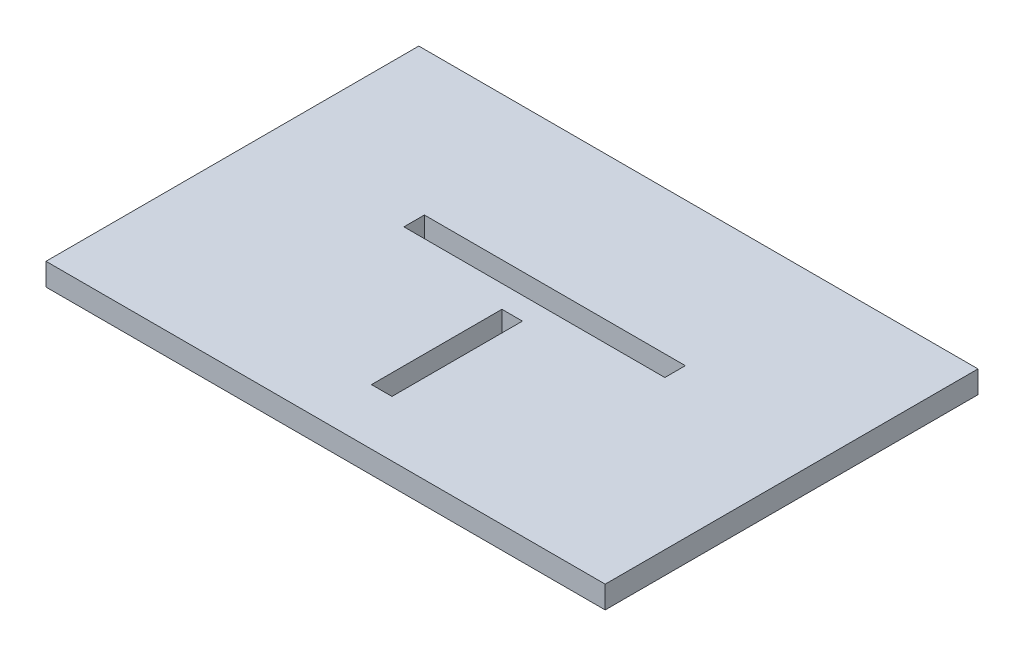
from build123d import *

# Parameters (mm, degrees)
SKETCH1_W           = 150
SKETCH1_H           = 100
SKETCH1_W_2         = 5.5
SKETCH1_H_2         = 35
SKETCH1_W_3         = 70
SKETCH1_H_3         = 5.5
BOSS_EXTRUDE1_DEPTH = 6


with BuildPart() as part:
    # Sketch1 → Boss-Extrude1 (new body)
    with BuildSketch(Plane(origin=(0, 0, 0), x_dir=(1, 0, 0), z_dir=(0, 1, 0))):
        Rectangle(SKETCH1_W, SKETCH1_H)
        with Locations((0.05, -17.5)):
            Rectangle(SKETCH1_W_2, SKETCH1_H_2, mode=Mode.SUBTRACT)
        with Locations((0, 8.75)):
            Rectangle(SKETCH1_W_3, SKETCH1_H_3, mode=Mode.SUBTRACT)
    extrude(amount=BOSS_EXTRUDE1_DEPTH)


solid = part.part
